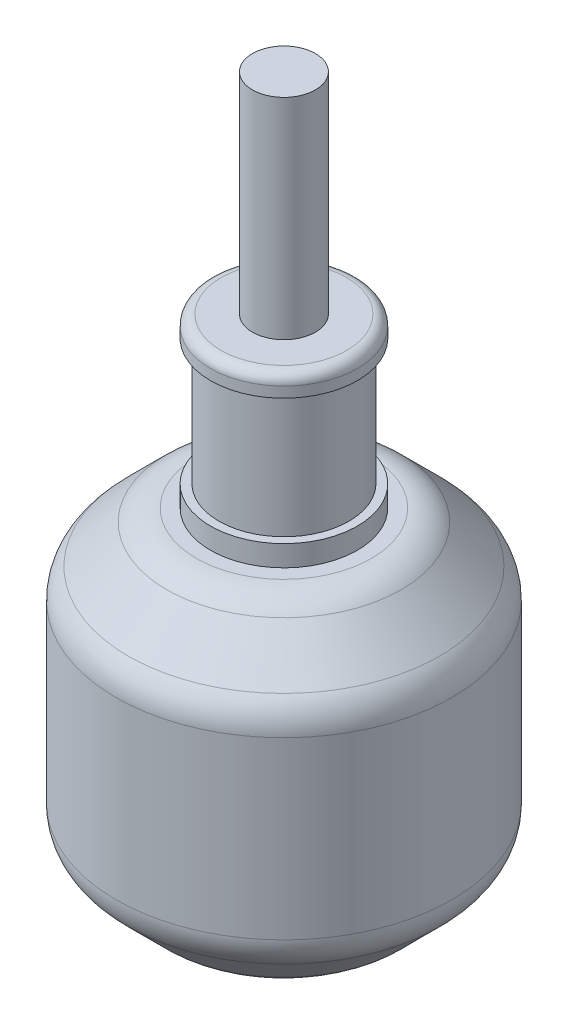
ISO-10303-21;
HEADER;
FILE_DESCRIPTION(('STEP AP214'),'2;1');
FILE_NAME('part.step','',(''),(''),'','','');
FILE_SCHEMA(('AUTOMOTIVE_DESIGN { 1 0 10303 214 1 1 1 1 }'));
ENDSEC;
DATA;
#1=APPLICATION_CONTEXT('core data for automotive mechanical design processes');
#2=APPLICATION_PROTOCOL_DEFINITION('international standard','automotive_design',2000,#1);
#3=PRODUCT_CONTEXT('',#1,'mechanical');
#4=PRODUCT('Part','Part','',(#3));
#5=PRODUCT_RELATED_PRODUCT_CATEGORY('part','',(#4));
#6=PRODUCT_DEFINITION_FORMATION('','',#4);
#7=PRODUCT_DEFINITION_CONTEXT('part definition',#1,'design');
#8=PRODUCT_DEFINITION('design','',#6,#7);
#9=PRODUCT_DEFINITION_SHAPE('','',#8);
#10=(LENGTH_UNIT() NAMED_UNIT(*) SI_UNIT(.MILLI.,.METRE.));
#11=(NAMED_UNIT(*) PLANE_ANGLE_UNIT() SI_UNIT($,.RADIAN.));
#12=(NAMED_UNIT(*) SI_UNIT($,.STERADIAN.) SOLID_ANGLE_UNIT());
#13=UNCERTAINTY_MEASURE_WITH_UNIT(LENGTH_MEASURE(1.E-05),#10,'distance_accuracy_value','');
#14=(GEOMETRIC_REPRESENTATION_CONTEXT(3) GLOBAL_UNCERTAINTY_ASSIGNED_CONTEXT((#13)) GLOBAL_UNIT_ASSIGNED_CONTEXT((#10,
#11,#12)) REPRESENTATION_CONTEXT('',''));
#15=CARTESIAN_POINT('',(0.,0.,0.));
#16=DIRECTION('',(0.,0.,1.));
#17=DIRECTION('',(1.,0.,0.));
#18=AXIS2_PLACEMENT_3D('',#15,#16,#17);
#19=CARTESIAN_POINT('',(0.,6.,0.));
#20=DIRECTION('',(0.,-1.,0.));
#21=DIRECTION('',(0.,0.,-1.));
#22=AXIS2_PLACEMENT_3D('',#19,#20,#21);
#23=CYLINDRICAL_SURFACE('',#22,3.1);
#24=CARTESIAN_POINT('',(0.,6.,0.));
#25=DIRECTION('',(0.,1.,0.));
#26=DIRECTION('',(0.,0.,1.));
#27=AXIS2_PLACEMENT_3D('',#24,#25,#26);
#28=CIRCLE('',#27,3.1);
#29=CARTESIAN_POINT('',(0.,6.,3.1));
#30=VERTEX_POINT('',#29);
#31=EDGE_CURVE('E56',#30,#30,#28,.T.);
#32=ORIENTED_EDGE('',*,*,#31,.F.);
#33=EDGE_LOOP('',(#32));
#34=FACE_BOUND('',#33,.T.);
#35=CARTESIAN_POINT('',(0.,0.,0.));
#36=DIRECTION('',(0.,1.,0.));
#37=DIRECTION('',(0.,0.,1.));
#38=AXIS2_PLACEMENT_3D('',#35,#36,#37);
#39=CIRCLE('',#38,3.1);
#40=CARTESIAN_POINT('',(0.,0.,3.1));
#41=VERTEX_POINT('',#40);
#42=EDGE_CURVE('E63',#41,#41,#39,.T.);
#43=ORIENTED_EDGE('',*,*,#42,.T.);
#44=EDGE_LOOP('',(#43));
#45=FACE_BOUND('',#44,.T.);
#46=ADVANCED_FACE('F45',(#34,#45),#23,.T.);
#47=CARTESIAN_POINT('',(0.,7.,0.));
#48=DIRECTION('',(0.,-1.,0.));
#49=DIRECTION('',(0.,0.,-1.));
#50=AXIS2_PLACEMENT_3D('',#47,#48,#49);
#51=CYLINDRICAL_SURFACE('',#50,3.5);
#52=CARTESIAN_POINT('',(0.,6.5,0.));
#53=DIRECTION('',(0.,1.,0.));
#54=DIRECTION('',(0.,0.,1.));
#55=AXIS2_PLACEMENT_3D('',#52,#53,#54);
#56=CIRCLE('',#55,3.5);
#57=CARTESIAN_POINT('',(0.,6.5,3.5));
#58=VERTEX_POINT('',#57);
#59=EDGE_CURVE('E10',#58,#58,#56,.F.);
#60=ORIENTED_EDGE('',*,*,#59,.T.);
#61=EDGE_LOOP('',(#60));
#62=FACE_BOUND('',#61,.T.);
#63=CARTESIAN_POINT('',(0.,6.,0.));
#64=DIRECTION('',(0.,1.,0.));
#65=DIRECTION('',(0.,0.,1.));
#66=AXIS2_PLACEMENT_3D('',#63,#64,#65);
#67=CIRCLE('',#66,3.5);
#68=CARTESIAN_POINT('',(0.,6.,3.5));
#69=VERTEX_POINT('',#68);
#70=EDGE_CURVE('E60',#69,#69,#67,.T.);
#71=ORIENTED_EDGE('',*,*,#70,.T.);
#72=EDGE_LOOP('',(#71));
#73=FACE_BOUND('',#72,.T.);
#74=ADVANCED_FACE('F116',(#62,#73),#51,.T.);
#75=CARTESIAN_POINT('',(0.,7.,0.));
#76=DIRECTION('',(0.,1.,0.));
#77=DIRECTION('',(0.,0.,1.));
#78=AXIS2_PLACEMENT_3D('',#75,#76,#77);
#79=PLANE('',#78);
#80=CARTESIAN_POINT('',(0.,7.,0.));
#81=DIRECTION('',(0.,1.,0.));
#82=DIRECTION('',(0.,0.,1.));
#83=AXIS2_PLACEMENT_3D('',#80,#81,#82);
#84=CIRCLE('',#83,1.5);
#85=CARTESIAN_POINT('',(0.,7.,1.5));
#86=VERTEX_POINT('',#85);
#87=EDGE_CURVE('E99',#86,#86,#84,.T.);
#88=ORIENTED_EDGE('',*,*,#87,.F.);
#89=EDGE_LOOP('',(#88));
#90=FACE_BOUND('',#89,.T.);
#91=CARTESIAN_POINT('',(0.,7.,0.));
#92=DIRECTION('',(0.,1.,0.));
#93=DIRECTION('',(0.,0.,1.));
#94=AXIS2_PLACEMENT_3D('',#91,#92,#93);
#95=CIRCLE('',#94,3.);
#96=CARTESIAN_POINT('',(0.,7.,3.));
#97=VERTEX_POINT('',#96);
#98=EDGE_CURVE('E52',#97,#97,#95,.T.);
#99=ORIENTED_EDGE('',*,*,#98,.T.);
#100=EDGE_LOOP('',(#99));
#101=FACE_BOUND('',#100,.T.);
#102=ADVANCED_FACE('F113',(#90,#101),#79,.T.);
#103=CARTESIAN_POINT('',(0.,6.,0.));
#104=DIRECTION('',(0.,1.,0.));
#105=DIRECTION('',(0.,0.,1.));
#106=AXIS2_PLACEMENT_3D('',#103,#104,#105);
#107=PLANE('',#106);
#108=ORIENTED_EDGE('',*,*,#31,.T.);
#109=EDGE_LOOP('',(#108));
#110=FACE_BOUND('',#109,.T.);
#111=ORIENTED_EDGE('',*,*,#70,.F.);
#112=EDGE_LOOP('',(#111));
#113=FACE_BOUND('',#112,.T.);
#114=ADVANCED_FACE('F115',(#110,#113),#107,.F.);
#115=CARTESIAN_POINT('',(0.,-1.,0.));
#116=DIRECTION('',(0.,1.,0.));
#117=DIRECTION('',(0.,0.,1.));
#118=AXIS2_PLACEMENT_3D('',#115,#116,#117);
#119=CYLINDRICAL_SURFACE('',#118,3.5);
#120=CARTESIAN_POINT('',(0.,-1.,0.));
#121=DIRECTION('',(0.,-1.,0.));
#122=DIRECTION('',(0.,0.,-1.));
#123=AXIS2_PLACEMENT_3D('',#120,#121,#122);
#124=CIRCLE('',#123,3.5);
#125=CARTESIAN_POINT('',(0.,-1.,-3.5));
#126=VERTEX_POINT('',#125);
#127=EDGE_CURVE('E65',#126,#126,#124,.T.);
#128=ORIENTED_EDGE('',*,*,#127,.F.);
#129=EDGE_LOOP('',(#128));
#130=FACE_BOUND('',#129,.T.);
#131=CARTESIAN_POINT('',(0.,0.,0.));
#132=DIRECTION('',(0.,-1.,0.));
#133=DIRECTION('',(0.,0.,-1.));
#134=AXIS2_PLACEMENT_3D('',#131,#132,#133);
#135=CIRCLE('',#134,3.5);
#136=CARTESIAN_POINT('',(0.,0.,-3.5));
#137=VERTEX_POINT('',#136);
#138=EDGE_CURVE('E69',#137,#137,#135,.T.);
#139=ORIENTED_EDGE('',*,*,#138,.T.);
#140=EDGE_LOOP('',(#139));
#141=FACE_BOUND('',#140,.T.);
#142=ADVANCED_FACE('F122',(#130,#141),#119,.T.);
#143=CARTESIAN_POINT('',(0.,0.,0.));
#144=DIRECTION('',(0.,-1.,0.));
#145=DIRECTION('',(0.,0.,-1.));
#146=AXIS2_PLACEMENT_3D('',#143,#144,#145);
#147=PLANE('',#146);
#148=ORIENTED_EDGE('',*,*,#42,.F.);
#149=EDGE_LOOP('',(#148));
#150=FACE_BOUND('',#149,.T.);
#151=ORIENTED_EDGE('',*,*,#138,.F.);
#152=EDGE_LOOP('',(#151));
#153=FACE_BOUND('',#152,.T.);
#154=ADVANCED_FACE('F135',(#150,#153),#147,.F.);
#155=CARTESIAN_POINT('',(0.,-1.,0.));
#156=DIRECTION('',(0.,-1.,0.));
#157=DIRECTION('',(1.,0.,0.));
#158=AXIS2_PLACEMENT_3D('',#155,#156,#157);
#159=PLANE('',#158);
#160=ORIENTED_EDGE('',*,*,#127,.T.);
#161=EDGE_LOOP('',(#160));
#162=FACE_BOUND('',#161,.T.);
#163=CARTESIAN_POINT('',(0.,-1.,0.));
#164=DIRECTION('',(0.,1.,0.));
#165=DIRECTION('',(-1.,0.,0.));
#166=AXIS2_PLACEMENT_3D('',#163,#164,#165);
#167=CIRCLE('',#166,4.1715728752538);
#168=CARTESIAN_POINT('',(-4.1715728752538,-1.,0.));
#169=VERTEX_POINT('',#168);
#170=EDGE_CURVE('E95',#169,#169,#167,.T.);
#171=ORIENTED_EDGE('',*,*,#170,.T.);
#172=EDGE_LOOP('',(#171));
#173=FACE_BOUND('',#172,.T.);
#174=ADVANCED_FACE('F138',(#162,#173),#159,.F.);
#175=CARTESIAN_POINT('',(4.1715728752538,-17.,0.));
#176=DIRECTION('',(0.,1.,0.));
#177=DIRECTION('',(-1.,0.,0.));
#178=AXIS2_PLACEMENT_3D('',#175,#176,#177);
#179=PLANE('',#178);
#180=CARTESIAN_POINT('',(0.,-17.,0.));
#181=DIRECTION('',(0.,1.,0.));
#182=DIRECTION('',(-1.,0.,0.));
#183=AXIS2_PLACEMENT_3D('',#180,#181,#182);
#184=CIRCLE('',#183,4.1715728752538);
#185=CARTESIAN_POINT('',(-4.1715728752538,-17.,0.));
#186=VERTEX_POINT('',#185);
#187=EDGE_CURVE('E72',#186,#186,#184,.T.);
#188=ORIENTED_EDGE('',*,*,#187,.F.);
#189=EDGE_LOOP('',(#188));
#190=FACE_BOUND('',#189,.T.);
#191=ADVANCED_FACE('F150',(#190),#179,.F.);
#192=CARTESIAN_POINT('',(0.,-15.,0.));
#193=DIRECTION('',(0.,1.,0.));
#194=DIRECTION('',(-1.,0.,0.));
#195=AXIS2_PLACEMENT_3D('',#192,#193,#194);
#196=TOROIDAL_SURFACE('',#195,4.17157287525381,2.);
#197=CARTESIAN_POINT('',(0.,-16.4142135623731,0.));
#198=DIRECTION('',(0.,1.,0.));
#199=DIRECTION('',(-1.,0.,0.));
#200=AXIS2_PLACEMENT_3D('',#197,#198,#199);
#201=CIRCLE('',#200,5.58578643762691);
#202=CARTESIAN_POINT('',(-5.58578643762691,-16.4142135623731,0.));
#203=VERTEX_POINT('',#202);
#204=EDGE_CURVE('E77',#203,#203,#201,.T.);
#205=ORIENTED_EDGE('',*,*,#204,.F.);
#206=EDGE_LOOP('',(#205));
#207=FACE_BOUND('',#206,.T.);
#208=ORIENTED_EDGE('',*,*,#187,.T.);
#209=EDGE_LOOP('',(#208));
#210=FACE_BOUND('',#209,.T.);
#211=ADVANCED_FACE('F154',(#207,#210),#196,.T.);
#212=CARTESIAN_POINT('',(0.,-16.4142135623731,0.));
#213=DIRECTION('',(0.,1.,0.));
#214=DIRECTION('',(-1.,0.,0.));
#215=AXIS2_PLACEMENT_3D('',#212,#213,#214);
#216=CONICAL_SURFACE('',#215,5.58578643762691,0.785398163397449);
#217=CARTESIAN_POINT('',(0.,-14.5857864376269,0.));
#218=DIRECTION('',(0.,1.,0.));
#219=DIRECTION('',(-1.,0.,0.));
#220=AXIS2_PLACEMENT_3D('',#217,#218,#219);
#221=CIRCLE('',#220,7.41421356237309);
#222=CARTESIAN_POINT('',(-7.41421356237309,-14.5857864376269,0.));
#223=VERTEX_POINT('',#222);
#224=EDGE_CURVE('E80',#223,#223,#221,.T.);
#225=ORIENTED_EDGE('',*,*,#224,.F.);
#226=EDGE_LOOP('',(#225));
#227=FACE_BOUND('',#226,.T.);
#228=ORIENTED_EDGE('',*,*,#204,.T.);
#229=EDGE_LOOP('',(#228));
#230=FACE_BOUND('',#229,.T.);
#231=ADVANCED_FACE('F158',(#227,#230),#216,.T.);
#232=CARTESIAN_POINT('',(0.,-13.1715728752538,0.));
#233=DIRECTION('',(0.,1.,0.));
#234=DIRECTION('',(-1.,0.,0.));
#235=AXIS2_PLACEMENT_3D('',#232,#233,#234);
#236=TOROIDAL_SURFACE('',#235,6.,2.);
#237=CARTESIAN_POINT('',(0.,-13.1715728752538,0.));
#238=DIRECTION('',(0.,1.,0.));
#239=DIRECTION('',(-1.,0.,0.));
#240=AXIS2_PLACEMENT_3D('',#237,#238,#239);
#241=CIRCLE('',#240,8.);
#242=CARTESIAN_POINT('',(-8.,-13.1715728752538,0.));
#243=VERTEX_POINT('',#242);
#244=EDGE_CURVE('E83',#243,#243,#241,.T.);
#245=ORIENTED_EDGE('',*,*,#244,.F.);
#246=EDGE_LOOP('',(#245));
#247=FACE_BOUND('',#246,.T.);
#248=ORIENTED_EDGE('',*,*,#224,.T.);
#249=EDGE_LOOP('',(#248));
#250=FACE_BOUND('',#249,.T.);
#251=ADVANCED_FACE('F162',(#247,#250),#236,.T.);
#252=CARTESIAN_POINT('',(0.,-1.,0.));
#253=DIRECTION('',(0.,1.,0.));
#254=DIRECTION('',(-1.,0.,0.));
#255=AXIS2_PLACEMENT_3D('',#252,#253,#254);
#256=CYLINDRICAL_SURFACE('',#255,8.);
#257=CARTESIAN_POINT('',(0.,-4.8284271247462,0.));
#258=DIRECTION('',(0.,1.,0.));
#259=DIRECTION('',(-1.,0.,0.));
#260=AXIS2_PLACEMENT_3D('',#257,#258,#259);
#261=CIRCLE('',#260,8.);
#262=CARTESIAN_POINT('',(-8.,-4.8284271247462,0.));
#263=VERTEX_POINT('',#262);
#264=EDGE_CURVE('E86',#263,#263,#261,.T.);
#265=ORIENTED_EDGE('',*,*,#264,.F.);
#266=EDGE_LOOP('',(#265));
#267=FACE_BOUND('',#266,.T.);
#268=ORIENTED_EDGE('',*,*,#244,.T.);
#269=EDGE_LOOP('',(#268));
#270=FACE_BOUND('',#269,.T.);
#271=ADVANCED_FACE('F166',(#267,#270),#256,.T.);
#272=CARTESIAN_POINT('',(0.,-4.82842712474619,0.));
#273=DIRECTION('',(0.,1.,0.));
#274=DIRECTION('',(-1.,0.,0.));
#275=AXIS2_PLACEMENT_3D('',#272,#273,#274);
#276=TOROIDAL_SURFACE('',#275,6.,2.);
#277=CARTESIAN_POINT('',(0.,-3.41421356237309,0.));
#278=DIRECTION('',(0.,1.,0.));
#279=DIRECTION('',(-1.,0.,0.));
#280=AXIS2_PLACEMENT_3D('',#277,#278,#279);
#281=CIRCLE('',#280,7.41421356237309);
#282=CARTESIAN_POINT('',(-7.41421356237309,-3.41421356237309,0.));
#283=VERTEX_POINT('',#282);
#284=EDGE_CURVE('E89',#283,#283,#281,.T.);
#285=ORIENTED_EDGE('',*,*,#284,.F.);
#286=EDGE_LOOP('',(#285));
#287=FACE_BOUND('',#286,.T.);
#288=ORIENTED_EDGE('',*,*,#264,.T.);
#289=EDGE_LOOP('',(#288));
#290=FACE_BOUND('',#289,.T.);
#291=ADVANCED_FACE('F170',(#287,#290),#276,.T.);
#292=CARTESIAN_POINT('',(0.,-3.41421356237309,0.));
#293=DIRECTION('',(0.,-1.,0.));
#294=DIRECTION('',(1.,0.,0.));
#295=AXIS2_PLACEMENT_3D('',#292,#293,#294);
#296=CONICAL_SURFACE('',#295,7.41421356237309,0.785398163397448);
#297=CARTESIAN_POINT('',(0.,-1.58578643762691,0.));
#298=DIRECTION('',(0.,1.,0.));
#299=DIRECTION('',(-1.,0.,0.));
#300=AXIS2_PLACEMENT_3D('',#297,#298,#299);
#301=CIRCLE('',#300,5.58578643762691);
#302=CARTESIAN_POINT('',(-5.58578643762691,-1.58578643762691,0.));
#303=VERTEX_POINT('',#302);
#304=EDGE_CURVE('E92',#303,#303,#301,.T.);
#305=ORIENTED_EDGE('',*,*,#304,.F.);
#306=EDGE_LOOP('',(#305));
#307=FACE_BOUND('',#306,.T.);
#308=ORIENTED_EDGE('',*,*,#284,.T.);
#309=EDGE_LOOP('',(#308));
#310=FACE_BOUND('',#309,.T.);
#311=ADVANCED_FACE('F174',(#307,#310),#296,.T.);
#312=CARTESIAN_POINT('',(0.,-3.,0.));
#313=DIRECTION('',(0.,1.,0.));
#314=DIRECTION('',(-1.,0.,0.));
#315=AXIS2_PLACEMENT_3D('',#312,#313,#314);
#316=TOROIDAL_SURFACE('',#315,4.17157287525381,2.);
#317=ORIENTED_EDGE('',*,*,#170,.F.);
#318=EDGE_LOOP('',(#317));
#319=FACE_BOUND('',#318,.T.);
#320=ORIENTED_EDGE('',*,*,#304,.T.);
#321=EDGE_LOOP('',(#320));
#322=FACE_BOUND('',#321,.T.);
#323=ADVANCED_FACE('F178',(#319,#322),#316,.T.);
#324=CARTESIAN_POINT('',(0.,6.5,0.));
#325=DIRECTION('',(0.,1.,0.));
#326=DIRECTION('',(0.,0.,1.));
#327=AXIS2_PLACEMENT_3D('',#324,#325,#326);
#328=TOROIDAL_SURFACE('',#327,3.,0.5);
#329=ORIENTED_EDGE('',*,*,#59,.F.);
#330=EDGE_LOOP('',(#329));
#331=FACE_BOUND('',#330,.T.);
#332=ORIENTED_EDGE('',*,*,#98,.F.);
#333=EDGE_LOOP('',(#332));
#334=FACE_BOUND('',#333,.T.);
#335=ADVANCED_FACE('F47',(#331,#334),#328,.T.);
#336=CARTESIAN_POINT('',(0.,17.,0.));
#337=DIRECTION('',(0.,-1.,0.));
#338=DIRECTION('',(0.,0.,-1.));
#339=AXIS2_PLACEMENT_3D('',#336,#337,#338);
#340=CYLINDRICAL_SURFACE('',#339,1.5);
#341=CARTESIAN_POINT('',(0.,17.,0.));
#342=DIRECTION('',(0.,1.,0.));
#343=DIRECTION('',(0.,0.,1.));
#344=AXIS2_PLACEMENT_3D('',#341,#342,#343);
#345=CIRCLE('',#344,1.5);
#346=CARTESIAN_POINT('',(0.,17.,1.5));
#347=VERTEX_POINT('',#346);
#348=EDGE_CURVE('E98',#347,#347,#345,.T.);
#349=ORIENTED_EDGE('',*,*,#348,.F.);
#350=EDGE_LOOP('',(#349));
#351=FACE_BOUND('',#350,.T.);
#352=ORIENTED_EDGE('',*,*,#87,.T.);
#353=EDGE_LOOP('',(#352));
#354=FACE_BOUND('',#353,.T.);
#355=ADVANCED_FACE('F107',(#351,#354),#340,.T.);
#356=CARTESIAN_POINT('',(0.,17.,0.));
#357=DIRECTION('',(0.,1.,0.));
#358=DIRECTION('',(0.,0.,1.));
#359=AXIS2_PLACEMENT_3D('',#356,#357,#358);
#360=PLANE('',#359);
#361=ORIENTED_EDGE('',*,*,#348,.T.);
#362=EDGE_LOOP('',(#361));
#363=FACE_BOUND('',#362,.T.);
#364=ADVANCED_FACE('F105',(#363),#360,.T.);
#365=CLOSED_SHELL('',(#46,#74,#102,#114,#142,#154,#174,#191,#211,#231,#251,#271,#291,#311,#323,
#335,#355,#364));
#366=MANIFOLD_SOLID_BREP('B2',#365);
#367=ADVANCED_BREP_SHAPE_REPRESENTATION('',(#18,#366),#14);
#368=SHAPE_DEFINITION_REPRESENTATION(#9,#367);
ENDSEC;
END-ISO-10303-21;
